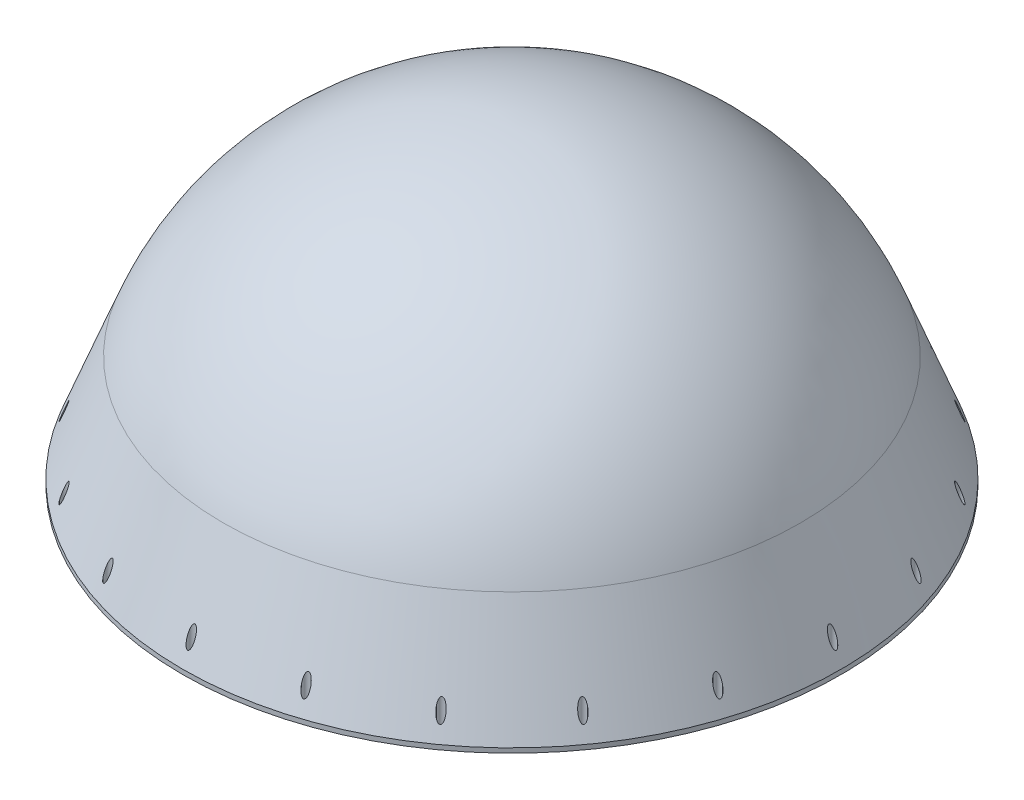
from build123d import *

# Parameters (mm, degrees)
CIRPATTERN1_COUNT = 20


with BuildPart() as part:
    # Sketch1 → Revolve1 (revolve)
    with BuildSketch(Plane.XY, mode=Mode.PRIVATE) as revolve1_sk:
        with BuildLine():
            Line((161.544, 0), (180.975, 0))
            Line((180.975, 0), (180.975, 2.54))
            Line((180.975, 2.54), (158.577896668, 60.879549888))
            ThreePointArc((158.577896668, 60.879549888), (96.20841014, 139.990037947), (0, 169.8625))
            Line((0, 169.8625), (0, 165.1))
            ThreePointArc((0, 165.1), (103.99798218, 128.228037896), (161.544, 34.081462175))
            Line((161.544, 34.081462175), (161.544, 0))
        make_face()
    revolve(revolve1_sk.sketch.rotate(Axis((0, 169.8625, 0), (0, -1, 0)), 90), axis=Axis((0, 169.8625, 0), (0, -1, 0)))

    # Sketch5 → 10-32 Tapped Hole1 (revolve, cut)
    with BuildSketch(Plane(origin=(-176.0728, 0, 0), x_dir=(0, 0, -1), z_dir=(1, 0, 0))):
        Polygon((0, 0), (0, 38.551317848), (2.0193, 37.338), (2.0193, 0), align=None)
    f_10_32_tapped_hole1 = revolve(axis=Axis((-176.0728, -6.35, 0), (0, 1, 0)), mode=Mode.SUBTRACT)

    # CirPattern1: 10-32 Tapped Hole1 ×20 about axis
    cirpattern1_axis = Axis((0, 0, 0), (0, 1, 0))
    for i in range(1, CIRPATTERN1_COUNT):
        add(f_10_32_tapped_hole1.rotate(cirpattern1_axis, i * 360 / CIRPATTERN1_COUNT), mode=Mode.SUBTRACT)

    # Sketch7 → Groove for AS 568-279_ O-Ring1 (revolve, cut)
    with BuildSketch(Plane(origin=(0, 0, 0), x_dir=(0, 0, -1), z_dir=(-1, 0, 0)), mode=Mode.PRIVATE) as groove_for_as_568_279_o_ring1_sk:
        with BuildLine():
            Line((164.8968, -2.235840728), (164.701189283, 0))
            Line((164.701189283, 0), (169.715210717, 0))
            Line((169.715210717, 0), (169.5196, -2.235840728))
            ThreePointArc((169.5196, -2.235840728), (169.377091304, -2.524819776), (169.076791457, -2.6416))
            Line((169.076791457, -2.6416), (165.339608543, -2.6416))
            ThreePointArc((165.339608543, -2.6416), (165.039308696, -2.524819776), (164.8968, -2.235840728))
        make_face()
    revolve(groove_for_as_568_279_o_ring1_sk.sketch.rotate(Axis((0, -50, 0), (0, 1, 0)), 180), axis=Axis((0, -50, 0), (0, 1, 0)), mode=Mode.SUBTRACT)


solid = part.part
